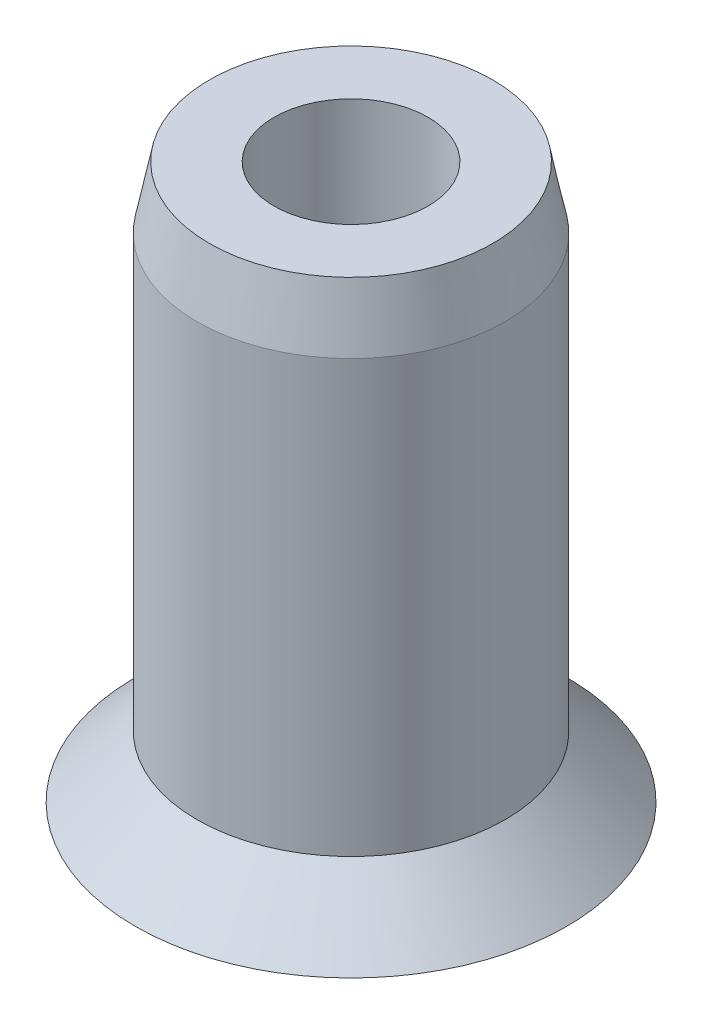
ISO-10303-21;
HEADER;
FILE_DESCRIPTION(('STEP AP214'),'2;1');
FILE_NAME('part.step','',(''),(''),'','','');
FILE_SCHEMA(('AUTOMOTIVE_DESIGN { 1 0 10303 214 1 1 1 1 }'));
ENDSEC;
DATA;
#1=APPLICATION_CONTEXT('core data for automotive mechanical design processes');
#2=APPLICATION_PROTOCOL_DEFINITION('international standard','automotive_design',2000,#1);
#3=PRODUCT_CONTEXT('',#1,'mechanical');
#4=PRODUCT('Part','Part','',(#3));
#5=PRODUCT_RELATED_PRODUCT_CATEGORY('part','',(#4));
#6=PRODUCT_DEFINITION_FORMATION('','',#4);
#7=PRODUCT_DEFINITION_CONTEXT('part definition',#1,'design');
#8=PRODUCT_DEFINITION('design','',#6,#7);
#9=PRODUCT_DEFINITION_SHAPE('','',#8);
#10=(LENGTH_UNIT() NAMED_UNIT(*) SI_UNIT(.MILLI.,.METRE.));
#11=(NAMED_UNIT(*) PLANE_ANGLE_UNIT() SI_UNIT($,.RADIAN.));
#12=(NAMED_UNIT(*) SI_UNIT($,.STERADIAN.) SOLID_ANGLE_UNIT());
#13=UNCERTAINTY_MEASURE_WITH_UNIT(LENGTH_MEASURE(1.E-05),#10,'distance_accuracy_value','');
#14=(GEOMETRIC_REPRESENTATION_CONTEXT(3) GLOBAL_UNCERTAINTY_ASSIGNED_CONTEXT((#13)) GLOBAL_UNIT_ASSIGNED_CONTEXT((#10,
#11,#12)) REPRESENTATION_CONTEXT('',''));
#15=CARTESIAN_POINT('',(0.,0.,0.));
#16=DIRECTION('',(0.,0.,1.));
#17=DIRECTION('',(1.,0.,0.));
#18=AXIS2_PLACEMENT_3D('',#15,#16,#17);
#19=CARTESIAN_POINT('',(-7.84142135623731,0.,0.));
#20=DIRECTION('',(0.,1.,0.));
#21=DIRECTION('',(0.,0.,1.));
#22=AXIS2_PLACEMENT_3D('',#19,#20,#21);
#23=PLANE('',#22);
#24=CARTESIAN_POINT('',(0.,0.,0.));
#25=DIRECTION('',(0.,1.,0.));
#26=DIRECTION('',(0.,0.,1.));
#27=AXIS2_PLACEMENT_3D('',#24,#25,#26);
#28=CIRCLE('',#27,3.5);
#29=CARTESIAN_POINT('',(0.,0.,3.5));
#30=VERTEX_POINT('',#29);
#31=EDGE_CURVE('E44',#30,#30,#28,.T.);
#32=ORIENTED_EDGE('',*,*,#31,.F.);
#33=EDGE_LOOP('',(#32));
#34=FACE_BOUND('',#33,.T.);
#35=CARTESIAN_POINT('',(0.,0.,0.));
#36=DIRECTION('',(0.,1.,0.));
#37=DIRECTION('',(0.,0.,1.));
#38=AXIS2_PLACEMENT_3D('',#35,#36,#37);
#39=CIRCLE('',#38,1.6);
#40=CARTESIAN_POINT('',(0.,0.,1.6));
#41=VERTEX_POINT('',#40);
#42=EDGE_CURVE('E54',#41,#41,#39,.T.);
#43=ORIENTED_EDGE('',*,*,#42,.T.);
#44=EDGE_LOOP('',(#43));
#45=FACE_BOUND('',#44,.T.);
#46=ADVANCED_FACE('F33',(#34,#45),#23,.F.);
#47=CARTESIAN_POINT('',(0.,9.,0.));
#48=DIRECTION('',(0.,-1.,0.));
#49=DIRECTION('',(0.,0.,-1.));
#50=AXIS2_PLACEMENT_3D('',#47,#48,#49);
#51=CYLINDRICAL_SURFACE('',#50,2.5);
#52=CARTESIAN_POINT('',(0.,7.99999999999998,0.));
#53=DIRECTION('',(0.,1.,0.));
#54=DIRECTION('',(0.,0.,1.));
#55=AXIS2_PLACEMENT_3D('',#52,#53,#54);
#56=CIRCLE('',#55,2.5);
#57=CARTESIAN_POINT('',(0.,7.99999999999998,2.5));
#58=VERTEX_POINT('',#57);
#59=EDGE_CURVE('E10',#58,#58,#56,.F.);
#60=ORIENTED_EDGE('',*,*,#59,.T.);
#61=EDGE_LOOP('',(#60));
#62=FACE_BOUND('',#61,.T.);
#63=CARTESIAN_POINT('',(0.,0.999999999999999,0.));
#64=DIRECTION('',(0.,1.,0.));
#65=DIRECTION('',(0.,0.,1.));
#66=AXIS2_PLACEMENT_3D('',#63,#64,#65);
#67=CIRCLE('',#66,2.5);
#68=CARTESIAN_POINT('',(0.,0.999999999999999,2.5));
#69=VERTEX_POINT('',#68);
#70=EDGE_CURVE('E48',#69,#69,#67,.F.);
#71=ORIENTED_EDGE('',*,*,#70,.F.);
#72=EDGE_LOOP('',(#71));
#73=FACE_BOUND('',#72,.T.);
#74=ADVANCED_FACE('F82',(#62,#73),#51,.T.);
#75=CARTESIAN_POINT('',(0.,9.,0.));
#76=DIRECTION('',(0.,1.,0.));
#77=DIRECTION('',(0.,0.,1.));
#78=AXIS2_PLACEMENT_3D('',#75,#76,#77);
#79=PLANE('',#78);
#80=CARTESIAN_POINT('',(0.,9.,0.));
#81=DIRECTION('',(0.,1.,0.));
#82=DIRECTION('',(0.,0.,1.));
#83=AXIS2_PLACEMENT_3D('',#80,#81,#82);
#84=CIRCLE('',#83,2.3);
#85=CARTESIAN_POINT('',(0.,9.,2.3));
#86=VERTEX_POINT('',#85);
#87=EDGE_CURVE('E40',#86,#86,#84,.T.);
#88=ORIENTED_EDGE('',*,*,#87,.T.);
#89=EDGE_LOOP('',(#88));
#90=FACE_BOUND('',#89,.T.);
#91=CARTESIAN_POINT('',(0.,9.,0.));
#92=DIRECTION('',(0.,-1.,0.));
#93=DIRECTION('',(0.,0.,-1.));
#94=AXIS2_PLACEMENT_3D('',#91,#92,#93);
#95=CIRCLE('',#94,1.25);
#96=CARTESIAN_POINT('',(0.,9.,-1.25));
#97=VERTEX_POINT('',#96);
#98=EDGE_CURVE('E57',#97,#97,#95,.T.);
#99=ORIENTED_EDGE('',*,*,#98,.T.);
#100=EDGE_LOOP('',(#99));
#101=FACE_BOUND('',#100,.T.);
#102=ADVANCED_FACE('F77',(#90,#101),#79,.T.);
#103=CARTESIAN_POINT('',(0.,4.,0.));
#104=DIRECTION('',(0.,-1.,0.));
#105=DIRECTION('',(0.,0.,-1.));
#106=AXIS2_PLACEMENT_3D('',#103,#104,#105);
#107=CYLINDRICAL_SURFACE('',#106,1.6);
#108=CARTESIAN_POINT('',(0.,4.,0.));
#109=DIRECTION('',(0.,1.,0.));
#110=DIRECTION('',(0.,0.,1.));
#111=AXIS2_PLACEMENT_3D('',#108,#109,#110);
#112=CIRCLE('',#111,1.6);
#113=CARTESIAN_POINT('',(0.,4.,1.6));
#114=VERTEX_POINT('',#113);
#115=EDGE_CURVE('E53',#114,#114,#112,.T.);
#116=ORIENTED_EDGE('',*,*,#115,.T.);
#117=EDGE_LOOP('',(#116));
#118=FACE_BOUND('',#117,.T.);
#119=ORIENTED_EDGE('',*,*,#42,.F.);
#120=EDGE_LOOP('',(#119));
#121=FACE_BOUND('',#120,.T.);
#122=ADVANCED_FACE('F71',(#118,#121),#107,.F.);
#123=CARTESIAN_POINT('',(-7.84142135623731,4.,0.));
#124=DIRECTION('',(0.,1.,0.));
#125=DIRECTION('',(0.,0.,1.));
#126=AXIS2_PLACEMENT_3D('',#123,#124,#125);
#127=PLANE('',#126);
#128=CARTESIAN_POINT('',(0.,4.,0.));
#129=DIRECTION('',(0.,-1.,0.));
#130=DIRECTION('',(0.,0.,-1.));
#131=AXIS2_PLACEMENT_3D('',#128,#129,#130);
#132=CIRCLE('',#131,1.25);
#133=CARTESIAN_POINT('',(0.,4.,-1.25));
#134=VERTEX_POINT('',#133);
#135=EDGE_CURVE('E62',#134,#134,#132,.T.);
#136=ORIENTED_EDGE('',*,*,#135,.F.);
#137=EDGE_LOOP('',(#136));
#138=FACE_BOUND('',#137,.T.);
#139=ORIENTED_EDGE('',*,*,#115,.F.);
#140=EDGE_LOOP('',(#139));
#141=FACE_BOUND('',#140,.T.);
#142=ADVANCED_FACE('F68',(#138,#141),#127,.F.);
#143=CARTESIAN_POINT('',(0.,4.,0.));
#144=DIRECTION('',(0.,-1.,0.));
#145=DIRECTION('',(0.,0.,-1.));
#146=AXIS2_PLACEMENT_3D('',#143,#144,#145);
#147=CYLINDRICAL_SURFACE('',#146,1.25);
#148=ORIENTED_EDGE('',*,*,#98,.F.);
#149=EDGE_LOOP('',(#148));
#150=FACE_BOUND('',#149,.T.);
#151=ORIENTED_EDGE('',*,*,#135,.T.);
#152=EDGE_LOOP('',(#151));
#153=FACE_BOUND('',#152,.T.);
#154=ADVANCED_FACE('F66',(#150,#153),#147,.F.);
#155=CARTESIAN_POINT('',(0.,9.,0.));
#156=DIRECTION('',(0.,-1.,0.));
#157=DIRECTION('',(0.,0.,-1.));
#158=AXIS2_PLACEMENT_3D('',#155,#156,#157);
#159=CONICAL_SURFACE('',#158,2.3,0.197395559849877);
#160=ORIENTED_EDGE('',*,*,#59,.F.);
#161=EDGE_LOOP('',(#160));
#162=FACE_BOUND('',#161,.T.);
#163=ORIENTED_EDGE('',*,*,#87,.F.);
#164=EDGE_LOOP('',(#163));
#165=FACE_BOUND('',#164,.T.);
#166=ADVANCED_FACE('F91',(#162,#165),#159,.T.);
#167=CARTESIAN_POINT('',(0.,1.,0.));
#168=DIRECTION('',(0.,-1.,0.));
#169=DIRECTION('',(0.,0.,-1.));
#170=AXIS2_PLACEMENT_3D('',#167,#168,#169);
#171=CONICAL_SURFACE('',#170,2.5,0.785398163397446);
#172=ORIENTED_EDGE('',*,*,#31,.T.);
#173=EDGE_LOOP('',(#172));
#174=FACE_BOUND('',#173,.T.);
#175=ORIENTED_EDGE('',*,*,#70,.T.);
#176=EDGE_LOOP('',(#175));
#177=FACE_BOUND('',#176,.T.);
#178=ADVANCED_FACE('F35',(#174,#177),#171,.T.);
#179=CLOSED_SHELL('',(#46,#74,#102,#122,#142,#154,#166,#178));
#180=MANIFOLD_SOLID_BREP('B2',#179);
#181=ADVANCED_BREP_SHAPE_REPRESENTATION('',(#18,#180),#14);
#182=SHAPE_DEFINITION_REPRESENTATION(#9,#181);
ENDSEC;
END-ISO-10303-21;
